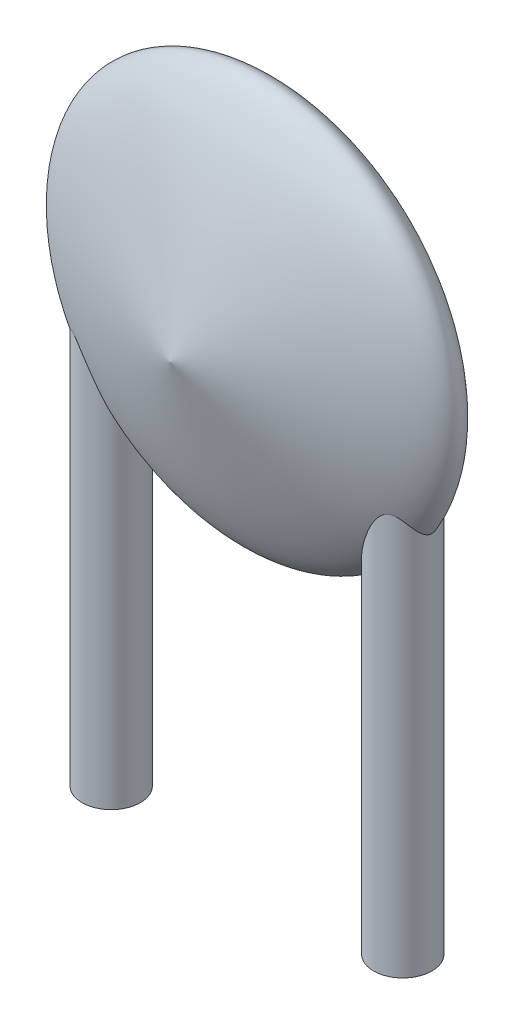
from build123d import *

# Parameters (mm, degrees)
ESQUISSE2_R      = 0.25
EXTRUSION1_DEPTH = 4.15


with BuildPart() as part:
    # Esquisse1 → R_volution1 (revolve)
    with BuildSketch(Plane(origin=(0, 0, 0), x_dir=(0, 0, -1), z_dir=(1, 0, 0))):
        with BuildLine():
            Line((-0.75, 0), (0.75, 0))
            add(Edge.make_bspline(
                [(-0.75, 0), (-0.5, 0.875), (0, 2.625), (0.5, 0.875), (0.75, 0)],
                knots=[0, 0, 0, 0, 0.5, 1, 1, 1, 1], degree=3))
        make_face()
    revolve(axis=Axis((0, 0, 4.802830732), (0, 0, -1)))

    # Esquisse2 → Extrusion1 (add)
    with BuildSketch(Plane(origin=(0, 0, 0), x_dir=(1, 0, 0), z_dir=(0, 1, 0))):
        with Locations(Location((-1.25, 0, 0), (0, 0, 270))):
            Circle(ESQUISSE2_R)
        with Locations(Location((1.25, 0, 0), (0, 0, 270))):
            Circle(ESQUISSE2_R)
    extrude(amount=-EXTRUSION1_DEPTH)


solid = part.part
